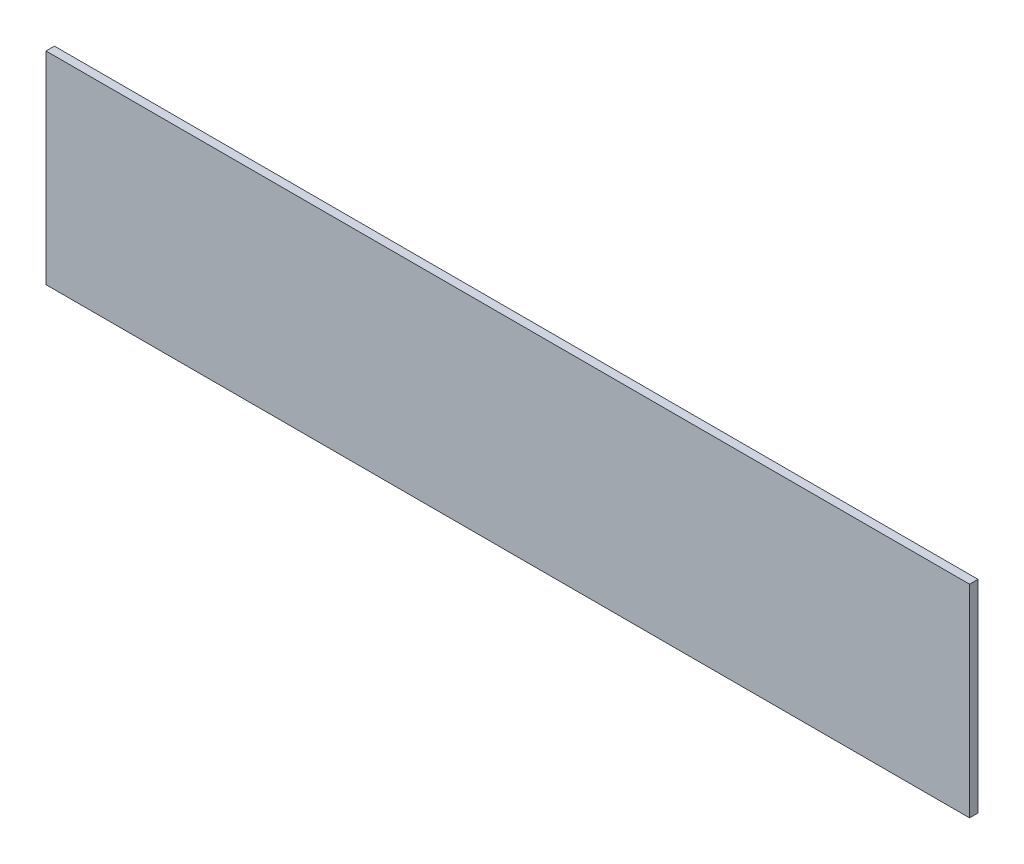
from build123d import *

# Parameters (mm, degrees)
SKETCH_1_W      = 657
SKETCH_1_H      = 144
EXTRUDE_1_DEPTH = 6


with BuildPart() as part:
    # Sketch 1 → Extrude 1 (new body)
    with BuildSketch(Plane.XY):
        with Locations((328.5, 72)):
            Rectangle(SKETCH_1_W, SKETCH_1_H)
    extrude(amount=EXTRUDE_1_DEPTH)


solid = part.part
